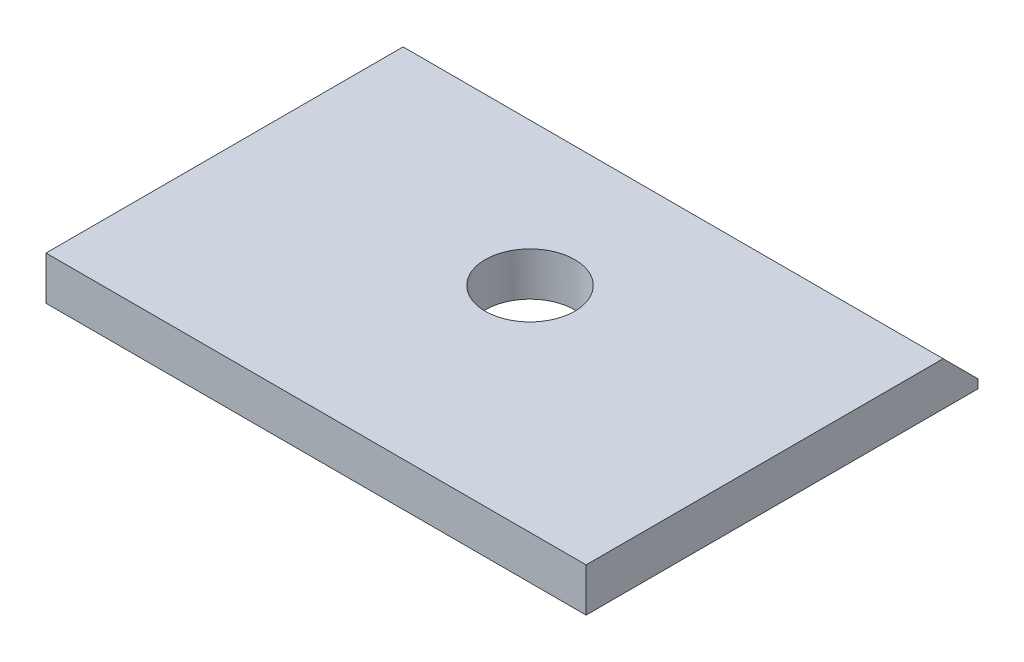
ISO-10303-21;
HEADER;
FILE_DESCRIPTION(('STEP AP214'),'2;1');
FILE_NAME('part.step','',(''),(''),'','','');
FILE_SCHEMA(('AUTOMOTIVE_DESIGN { 1 0 10303 214 1 1 1 1 }'));
ENDSEC;
DATA;
#1=APPLICATION_CONTEXT('core data for automotive mechanical design processes');
#2=APPLICATION_PROTOCOL_DEFINITION('international standard','automotive_design',2000,#1);
#3=PRODUCT_CONTEXT('',#1,'mechanical');
#4=PRODUCT('Part','Part','',(#3));
#5=PRODUCT_RELATED_PRODUCT_CATEGORY('part','',(#4));
#6=PRODUCT_DEFINITION_FORMATION('','',#4);
#7=PRODUCT_DEFINITION_CONTEXT('part definition',#1,'design');
#8=PRODUCT_DEFINITION('design','',#6,#7);
#9=PRODUCT_DEFINITION_SHAPE('','',#8);
#10=(LENGTH_UNIT() NAMED_UNIT(*) SI_UNIT(.MILLI.,.METRE.));
#11=(NAMED_UNIT(*) PLANE_ANGLE_UNIT() SI_UNIT($,.RADIAN.));
#12=(NAMED_UNIT(*) SI_UNIT($,.STERADIAN.) SOLID_ANGLE_UNIT());
#13=UNCERTAINTY_MEASURE_WITH_UNIT(LENGTH_MEASURE(1.E-05),#10,'distance_accuracy_value','');
#14=(GEOMETRIC_REPRESENTATION_CONTEXT(3) GLOBAL_UNCERTAINTY_ASSIGNED_CONTEXT((#13)) GLOBAL_UNIT_ASSIGNED_CONTEXT((#10,
#11,#12)) REPRESENTATION_CONTEXT('',''));
#15=CARTESIAN_POINT('',(0.,0.,0.));
#16=DIRECTION('',(0.,0.,1.));
#17=DIRECTION('',(1.,0.,0.));
#18=AXIS2_PLACEMENT_3D('',#15,#16,#17);
#19=CARTESIAN_POINT('',(-9.845,-3.81,12.7));
#20=DIRECTION('',(0.,-1.,0.));
#21=DIRECTION('',(0.,0.,-1.));
#22=AXIS2_PLACEMENT_3D('',#19,#20,#21);
#23=PLANE('',#22);
#24=DIRECTION('',(1.,0.,0.));
#25=VECTOR('',#24,1.);
#26=CARTESIAN_POINT('',(-9.845,-3.81000000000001,-1.5875));
#27=LINE('',#26,#25);
#28=CARTESIAN_POINT('',(-9.845,-3.81000000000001,-1.5875));
#29=VERTEX_POINT('',#28);
#30=CARTESIAN_POINT('',(9.845,-3.81000000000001,-1.5875));
#31=VERTEX_POINT('',#30);
#32=EDGE_CURVE('E127',#29,#31,#27,.T.);
#33=ORIENTED_EDGE('',*,*,#32,.T.);
#34=DIRECTION('',(0.,0.,-1.));
#35=VECTOR('',#34,1.);
#36=CARTESIAN_POINT('',(9.845,-3.81,12.7));
#37=LINE('',#36,#35);
#38=CARTESIAN_POINT('',(9.845,-3.81,12.7));
#39=VERTEX_POINT('',#38);
#40=EDGE_CURVE('E99',#39,#31,#37,.T.);
#41=ORIENTED_EDGE('',*,*,#40,.F.);
#42=DIRECTION('',(1.,0.,0.));
#43=VECTOR('',#42,1.);
#44=CARTESIAN_POINT('',(-9.845,-3.81,12.7));
#45=LINE('',#44,#43);
#46=CARTESIAN_POINT('',(-9.845,-3.81,12.7));
#47=VERTEX_POINT('',#46);
#48=EDGE_CURVE('E97',#47,#39,#45,.T.);
#49=ORIENTED_EDGE('',*,*,#48,.F.);
#50=DIRECTION('',(0.,0.,-1.));
#51=VECTOR('',#50,1.);
#52=CARTESIAN_POINT('',(-9.845,-3.81,12.7));
#53=LINE('',#52,#51);
#54=EDGE_CURVE('E110',#47,#29,#53,.T.);
#55=ORIENTED_EDGE('',*,*,#54,.T.);
#56=EDGE_LOOP('',(#33,#41,#49,#55));
#57=FACE_BOUND('',#56,.T.);
#58=CARTESIAN_POINT('',(0.,-3.81000000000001,4.9));
#59=DIRECTION('',(0.,1.,0.));
#60=DIRECTION('',(0.,0.,1.));
#61=AXIS2_PLACEMENT_3D('',#58,#59,#60);
#62=CIRCLE('',#61,1.63195);
#63=CARTESIAN_POINT('',(0.,-3.81000000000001,6.53194999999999));
#64=VERTEX_POINT('',#63);
#65=EDGE_CURVE('E100',#64,#64,#62,.T.);
#66=ORIENTED_EDGE('',*,*,#65,.T.);
#67=EDGE_LOOP('',(#66));
#68=FACE_BOUND('',#67,.T.);
#69=ADVANCED_FACE('F36',(#57,#68),#23,.T.);
#70=CARTESIAN_POINT('',(-9.845,0.,12.7));
#71=DIRECTION('',(0.,0.,1.));
#72=DIRECTION('',(1.,0.,0.));
#73=AXIS2_PLACEMENT_3D('',#70,#71,#72);
#74=PLANE('',#73);
#75=DIRECTION('',(1.,0.,0.));
#76=VECTOR('',#75,1.);
#77=CARTESIAN_POINT('',(-9.845,-2.2225,12.7));
#78=LINE('',#77,#76);
#79=CARTESIAN_POINT('',(-9.845,-2.2225,12.7));
#80=VERTEX_POINT('',#79);
#81=CARTESIAN_POINT('',(9.845,-2.2225,12.7));
#82=VERTEX_POINT('',#81);
#83=EDGE_CURVE('E80',#80,#82,#78,.T.);
#84=ORIENTED_EDGE('',*,*,#83,.F.);
#85=DIRECTION('',(0.,-1.,0.));
#86=VECTOR('',#85,1.);
#87=CARTESIAN_POINT('',(-9.845,0.,12.7));
#88=LINE('',#87,#86);
#89=EDGE_CURVE('E102',#80,#47,#88,.T.);
#90=ORIENTED_EDGE('',*,*,#89,.T.);
#91=ORIENTED_EDGE('',*,*,#48,.T.);
#92=DIRECTION('',(0.,-1.,0.));
#93=VECTOR('',#92,1.);
#94=CARTESIAN_POINT('',(9.845,0.,12.7));
#95=LINE('',#94,#93);
#96=EDGE_CURVE('E92',#82,#39,#95,.T.);
#97=ORIENTED_EDGE('',*,*,#96,.F.);
#98=EDGE_LOOP('',(#84,#90,#91,#97));
#99=FACE_BOUND('',#98,.T.);
#100=ADVANCED_FACE('F95',(#99),#74,.T.);
#101=CARTESIAN_POINT('',(-9.845,-3.81,-12.7));
#102=DIRECTION('',(1.,0.,0.));
#103=DIRECTION('',(0.,0.,-1.));
#104=AXIS2_PLACEMENT_3D('',#101,#102,#103);
#105=PLANE('',#104);
#106=DIRECTION('',(0.,0.,-1.));
#107=VECTOR('',#106,1.);
#108=CARTESIAN_POINT('',(-9.845,-2.2225,-12.7));
#109=LINE('',#108,#107);
#110=CARTESIAN_POINT('',(-9.845,-2.2225,-0.317499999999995));
#111=VERTEX_POINT('',#110);
#112=EDGE_CURVE('E84',#80,#111,#109,.T.);
#113=ORIENTED_EDGE('',*,*,#112,.T.);
#114=DIRECTION('',(0.,0.707106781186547,0.707106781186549));
#115=VECTOR('',#114,1.);
#116=CARTESIAN_POINT('',(-9.845,-3.49250000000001,-1.5875));
#117=LINE('',#116,#115);
#118=CARTESIAN_POINT('',(-9.845,-3.49250000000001,-1.5875));
#119=VERTEX_POINT('',#118);
#120=EDGE_CURVE('E12',#111,#119,#117,.F.);
#121=ORIENTED_EDGE('',*,*,#120,.T.);
#122=DIRECTION('',(0.,1.,0.));
#123=VECTOR('',#122,1.);
#124=CARTESIAN_POINT('',(-9.845,-3.81000000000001,-1.5875));
#125=LINE('',#124,#123);
#126=EDGE_CURVE('E123',#29,#119,#125,.T.);
#127=ORIENTED_EDGE('',*,*,#126,.F.);
#128=ORIENTED_EDGE('',*,*,#54,.F.);
#129=ORIENTED_EDGE('',*,*,#89,.F.);
#130=EDGE_LOOP('',(#113,#121,#127,#128,#129));
#131=FACE_BOUND('',#130,.T.);
#132=ADVANCED_FACE('F133',(#131),#105,.F.);
#133=CARTESIAN_POINT('',(9.845,-3.81,-12.7));
#134=DIRECTION('',(1.,0.,0.));
#135=DIRECTION('',(0.,0.,-1.));
#136=AXIS2_PLACEMENT_3D('',#133,#134,#135);
#137=PLANE('',#136);
#138=DIRECTION('',(0.,1.,0.));
#139=VECTOR('',#138,1.);
#140=CARTESIAN_POINT('',(9.845,-3.81000000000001,-1.5875));
#141=LINE('',#140,#139);
#142=CARTESIAN_POINT('',(9.845,-3.4925,-1.5875));
#143=VERTEX_POINT('',#142);
#144=EDGE_CURVE('E105',#31,#143,#141,.T.);
#145=ORIENTED_EDGE('',*,*,#144,.T.);
#146=DIRECTION('',(0.,-0.707106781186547,-0.707106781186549));
#147=VECTOR('',#146,1.);
#148=CARTESIAN_POINT('',(9.845,-9.2075,-7.30250000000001));
#149=LINE('',#148,#147);
#150=CARTESIAN_POINT('',(9.845,-2.2225,-0.31749999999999));
#151=VERTEX_POINT('',#150);
#152=EDGE_CURVE('E58',#143,#151,#149,.F.);
#153=ORIENTED_EDGE('',*,*,#152,.T.);
#154=DIRECTION('',(0.,0.,-1.));
#155=VECTOR('',#154,1.);
#156=CARTESIAN_POINT('',(9.845,-2.2225,-12.7));
#157=LINE('',#156,#155);
#158=EDGE_CURVE('E83',#82,#151,#157,.T.);
#159=ORIENTED_EDGE('',*,*,#158,.F.);
#160=ORIENTED_EDGE('',*,*,#96,.T.);
#161=ORIENTED_EDGE('',*,*,#40,.T.);
#162=EDGE_LOOP('',(#145,#153,#159,#160,#161));
#163=FACE_BOUND('',#162,.T.);
#164=ADVANCED_FACE('F90',(#163),#137,.T.);
#165=CARTESIAN_POINT('',(0.,0.,4.9));
#166=DIRECTION('',(0.,1.,0.));
#167=DIRECTION('',(0.,0.,1.));
#168=AXIS2_PLACEMENT_3D('',#165,#166,#167);
#169=CYLINDRICAL_SURFACE('',#168,1.63194999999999);
#170=CARTESIAN_POINT('',(0.,-2.2225,4.9));
#171=DIRECTION('',(0.,-1.,0.));
#172=DIRECTION('',(0.,0.,-1.));
#173=AXIS2_PLACEMENT_3D('',#170,#171,#172);
#174=CIRCLE('',#173,1.63194999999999);
#175=CARTESIAN_POINT('',(0.,-2.2225,3.26805));
#176=VERTEX_POINT('',#175);
#177=EDGE_CURVE('E88',#176,#176,#174,.F.);
#178=ORIENTED_EDGE('',*,*,#177,.T.);
#179=EDGE_LOOP('',(#178));
#180=FACE_BOUND('',#179,.T.);
#181=ORIENTED_EDGE('',*,*,#65,.F.);
#182=EDGE_LOOP('',(#181));
#183=FACE_BOUND('',#182,.T.);
#184=ADVANCED_FACE('F152',(#180,#183),#169,.F.);
#185=CARTESIAN_POINT('',(-9.845,-3.81000000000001,-1.5875));
#186=DIRECTION('',(0.,0.,1.));
#187=DIRECTION('',(1.,0.,0.));
#188=AXIS2_PLACEMENT_3D('',#185,#186,#187);
#189=PLANE('',#188);
#190=ORIENTED_EDGE('',*,*,#126,.T.);
#191=DIRECTION('',(1.,0.,0.));
#192=VECTOR('',#191,1.);
#193=CARTESIAN_POINT('',(-9.845,-3.49250000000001,-1.5875));
#194=LINE('',#193,#192);
#195=EDGE_CURVE('E114',#119,#143,#194,.T.);
#196=ORIENTED_EDGE('',*,*,#195,.T.);
#197=ORIENTED_EDGE('',*,*,#144,.F.);
#198=ORIENTED_EDGE('',*,*,#32,.F.);
#199=EDGE_LOOP('',(#190,#196,#197,#198));
#200=FACE_BOUND('',#199,.T.);
#201=ADVANCED_FACE('F120',(#200),#189,.F.);
#202=CARTESIAN_POINT('',(-9.845,-2.2225,12.7));
#203=DIRECTION('',(0.,-1.,0.));
#204=DIRECTION('',(0.,0.,-1.));
#205=AXIS2_PLACEMENT_3D('',#202,#203,#204);
#206=PLANE('',#205);
#207=ORIENTED_EDGE('',*,*,#158,.T.);
#208=DIRECTION('',(-1.,0.,0.));
#209=VECTOR('',#208,1.);
#210=CARTESIAN_POINT('',(-9.845,-2.2225,-0.31749999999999));
#211=LINE('',#210,#209);
#212=EDGE_CURVE('E44',#151,#111,#211,.T.);
#213=ORIENTED_EDGE('',*,*,#212,.T.);
#214=ORIENTED_EDGE('',*,*,#112,.F.);
#215=ORIENTED_EDGE('',*,*,#83,.T.);
#216=EDGE_LOOP('',(#207,#213,#214,#215));
#217=FACE_BOUND('',#216,.T.);
#218=ORIENTED_EDGE('',*,*,#177,.F.);
#219=EDGE_LOOP('',(#218));
#220=FACE_BOUND('',#219,.T.);
#221=ADVANCED_FACE('F81',(#217,#220),#206,.F.);
#222=CARTESIAN_POINT('',(-9.845,-3.49250000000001,-1.5875));
#223=DIRECTION('',(0.,-0.707106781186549,0.707106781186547));
#224=DIRECTION('',(0.,-0.707106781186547,-0.707106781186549));
#225=AXIS2_PLACEMENT_3D('',#222,#223,#224);
#226=PLANE('',#225);
#227=ORIENTED_EDGE('',*,*,#120,.F.);
#228=ORIENTED_EDGE('',*,*,#212,.F.);
#229=ORIENTED_EDGE('',*,*,#152,.F.);
#230=ORIENTED_EDGE('',*,*,#195,.F.);
#231=EDGE_LOOP('',(#227,#228,#229,#230));
#232=FACE_BOUND('',#231,.T.);
#233=ADVANCED_FACE('F38',(#232),#226,.F.);
#234=CLOSED_SHELL('',(#69,#100,#132,#164,#184,#201,#221,#233));
#235=MANIFOLD_SOLID_BREP('B2',#234);
#236=ADVANCED_BREP_SHAPE_REPRESENTATION('',(#18,#235),#14);
#237=SHAPE_DEFINITION_REPRESENTATION(#9,#236);
ENDSEC;
END-ISO-10303-21;
